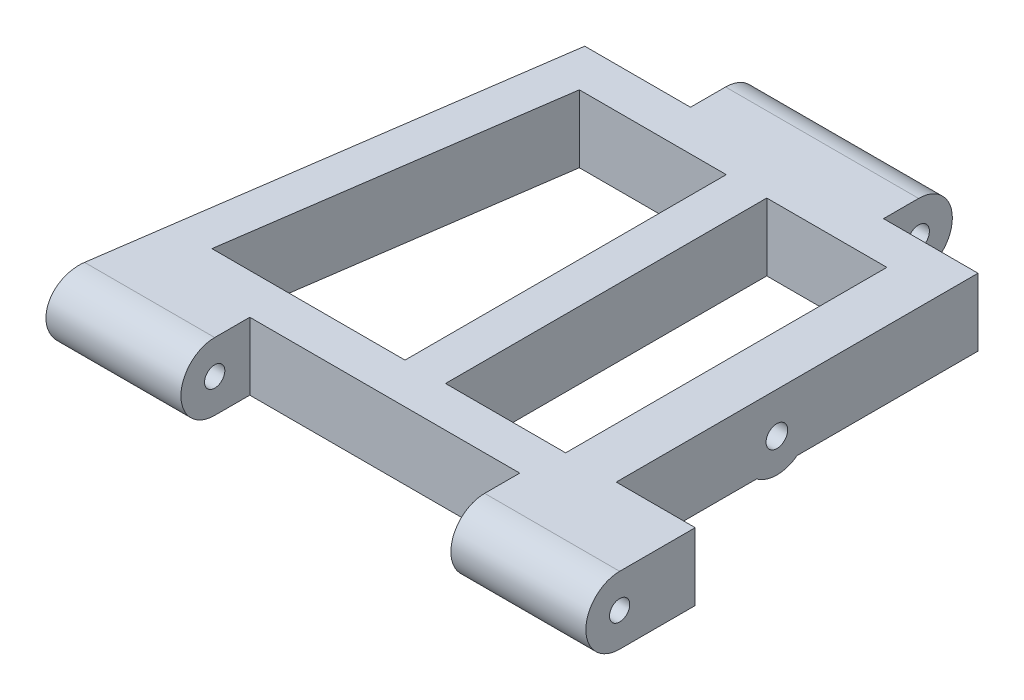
from build123d import *

# Parameters (mm, degrees)
SKETCH_1_W               = 3
SKETCH_1_H               = 6
SKETCH_1_W_2             = 7.5
SKETCH_1_H_2             = 47.6
EXTRUDE_1_DEPTH          = 10
SKETCH_2_R               = 1.6
CUT_EXTRUDE_1_DEPTH      = 28.6
CUT_EXTRUDE_2_DEPTH      = 123.883690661
CUT_EXTRUDE_2_DEPTH_BACK = 123.883690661
SKETCH_3_R               = 1.5
EXTRUDE_2_DEPTH          = 7.5
CUT_EXTRUDE_3_DEPTH      = 10


with BuildPart() as part:
    # Sketch 1 → Extrude 1 (new body)
    with BuildSketch(Plane(origin=(0, 0, 0), x_dir=(1, 0, 0), z_dir=(0, 1, 0))):
        Polygon((-128.03752184, 90.119148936), (-128.03752184, 96.119148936), (-129.50377184, 96.119148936), (-130.36627184, 90.119148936), align=None)
        Polygon((-124.304596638, 90.119148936), (-123.442096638, 96.119148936), (-127.83752184, 96.119148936), (-128.03752184, 96.119148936), (-128.03752184, 90.119148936), align=None)
        Polygon((-102.53752184, 96.119148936), (-113.83752184, 96.119148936), (-123.442096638, 96.119148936), (-124.304596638, 90.119148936), (-102.53752184, 90.119148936), align=None)
        Polygon((-113.83752184, 106.319148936), (-113.83752184, 96.119148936), (-102.53752184, 96.119148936), (-99.53752184, 96.119148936), (-99.53752184, 106.319148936), align=None)
        Polygon((-99.53752184, 106.319148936), (-99.53752184, 96.119148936), (-96.53752184, 96.119148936), (-85.23752184, 96.119148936), (-85.23752184, 106.319148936), align=None)
        with Locations((-98.03752184, 93.119148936)):
            Rectangle(SKETCH_1_W, SKETCH_1_H)
        with Locations((-101.03752184, 93.119148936)):
            Rectangle(SKETCH_1_W, SKETCH_1_H)
        Polygon((-99.53752184, 90.119148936), (-102.53752184, 90.119148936), (-102.53752184, 42.519148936), (-99.53752184, 42.519148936), (-99.53752184, 47.377424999), align=None)
        Polygon((-96.53752184, 90.119148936), (-99.53752184, 90.119148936), (-99.53752184, 47.377424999), (-99.53752184, 42.519148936), (-96.53752184, 42.519148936), align=None)
        Polygon((-85.23752184, 96.119148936), (-96.53752184, 96.119148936), (-96.53752184, 90.119148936), (-78.73752184, 90.119148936), (-71.23752184, 90.119148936), (-71.23752184, 96.119148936), align=None)
        with Locations((-74.98752184, 66.319148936)):
            Rectangle(SKETCH_1_W_2, SKETCH_1_H_2)
        Polygon((-128.03752184, 64.150973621), (-124.304596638, 90.119148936), (-128.03752184, 90.119148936), align=None)
        Polygon((-128.03752184, 64.150973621), (-128.03752184, 90.119148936), (-130.36627184, 90.119148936), (-137.20877184, 42.519148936), (-131.147096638, 42.519148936), align=None)
        Polygon((-133.475846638, 26.319148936), (-131.147096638, 42.519148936), (-137.20877184, 42.519148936), (-139.53752184, 26.319148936), align=None)
        Polygon((-128.03752184, 26.319148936), (-128.03752184, 42.519148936), (-131.147096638, 42.519148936), (-133.475846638, 26.319148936), align=None)
        Polygon((-99.53752184, 42.519148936), (-102.53752184, 42.519148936), (-128.03752184, 42.519148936), (-128.03752184, 26.319148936), (-119.53752184, 26.319148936), (-119.53752184, 36.519148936), (-99.53752184, 36.519148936), align=None)
        Polygon((-96.53752184, 42.519148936), (-99.53752184, 42.519148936), (-99.53752184, 36.519148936), (-79.53752184, 36.519148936), (-79.53752184, 26.319148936), (-71.03752184, 26.319148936), (-59.53752184, 26.319148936), (-59.53752184, 42.519148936), (-71.23752184, 42.519148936), (-78.73752184, 42.519148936), align=None)
    extrude(amount=EXTRUDE_1_DEPTH)

    # Sketch 2 → Cut-Extrude 1 (cut)
    with BuildSketch(Plane.ZY.offset(113.83752184)):
        with Locations((-101.319148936, 5)):
            Circle(SKETCH_2_R)
        with BuildLine():
            Line((-106.319148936, 10), (-106.319148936, 5))
            ThreePointArc((-106.319148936, 5), (-104.854682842, 8.535533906), (-101.319148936, 10))
            Line((-101.319148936, 10), (-106.319148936, 10))
        make_face()
        with BuildLine():
            Line((-106.319148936, 5), (-106.319148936, 0))
            Line((-106.319148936, 0), (-101.319148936, 0))
            ThreePointArc((-101.319148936, 0), (-104.854682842, 1.464466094), (-106.319148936, 5))
        make_face()
    extrude(amount=-CUT_EXTRUDE_1_DEPTH, mode=Mode.SUBTRACT)

    # Sketch 3 → Cut-Extrude 2 (cut, two sides: drawn at the far end of the back side and taken through both)
    with BuildSketch(Plane.ZY.offset(78.73752184).offset(-CUT_EXTRUDE_2_DEPTH_BACK)):
        with Locations((-31.319148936, 5)):
            Circle(SKETCH_3_R)
        with BuildLine():
            Line((-26.319148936, 10), (-31.319148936, 10))
            ThreePointArc((-31.319148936, 10), (-27.78361503, 8.535533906), (-26.319148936, 5))
            Line((-26.319148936, 5), (-26.319148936, 10))
        make_face()
        with BuildLine():
            ThreePointArc((-26.319148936, 5), (-27.78361503, 1.464466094), (-31.319148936, 0))
            Line((-31.319148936, 0), (-26.319148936, 0))
            Line((-26.319148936, 0), (-26.319148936, 5))
        make_face()
    extrude(amount=CUT_EXTRUDE_2_DEPTH + CUT_EXTRUDE_2_DEPTH_BACK, mode=Mode.SUBTRACT)

    # Sketch 4 → Extrude 2 (add)
    with BuildSketch(Plane.ZY.offset(78.73752184)):
        with BuildLine():
            Line((-66.319148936, 0), (-69.319148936, 0))
            ThreePointArc((-69.319148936, 0), (-67.900287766, -0.74341649), (-66.319148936, -1))
            Line((-66.319148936, -1), (-66.319148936, 0))
        make_face()
        with BuildLine():
            ThreePointArc((-66.319148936, -1), (-64.738010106, -0.74341649), (-63.319148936, 0))
            Line((-63.319148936, 0), (-66.319148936, 0))
            Line((-66.319148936, 0), (-66.319148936, -1))
        make_face()
        with BuildLine():
            Line((-66.319148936, 0), (-69.319148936, 0))
            ThreePointArc((-69.319148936, 0), (-67.900287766, -0.74341649), (-66.319148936, -1))
            Line((-66.319148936, -1), (-66.319148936, 0))
        make_face()
        with BuildLine():
            ThreePointArc((-66.319148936, -1), (-64.738010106, -0.74341649), (-63.319148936, 0))
            Line((-63.319148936, 0), (-66.319148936, 0))
            Line((-66.319148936, 0), (-66.319148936, -1))
        make_face()
    extrude(amount=-EXTRUDE_2_DEPTH)

    # Sketch 4_3 → Cut-Extrude 3 (cut)
    with BuildSketch(Plane.ZY.offset(78.73752184)):
        with BuildLine():
            ThreePointArc((-64.719148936, 4), (-65.187778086, 5.13137085), (-66.319148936, 5.6))
            Line((-66.319148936, 5.6), (-66.319148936, 2.4))
            ThreePointArc((-66.319148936, 2.4), (-65.187778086, 2.86862915), (-64.719148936, 4))
        make_face()
        with BuildLine():
            Line((-66.319148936, 2.4), (-66.319148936, 5.6))
            ThreePointArc((-66.319148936, 5.6), (-67.919148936, 4), (-66.319148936, 2.4))
        make_face()
        with BuildLine():
            ThreePointArc((-64.719148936, 4), (-65.187778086, 5.13137085), (-66.319148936, 5.6))
            Line((-66.319148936, 5.6), (-66.319148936, 2.4))
            ThreePointArc((-66.319148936, 2.4), (-65.187778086, 2.86862915), (-64.719148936, 4))
        make_face()
        with BuildLine():
            Line((-66.319148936, 2.4), (-66.319148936, 5.6))
            ThreePointArc((-66.319148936, 5.6), (-67.919148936, 4), (-66.319148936, 2.4))
        make_face()
    extrude(amount=-CUT_EXTRUDE_3_DEPTH, mode=Mode.SUBTRACT)


solid = part.part
